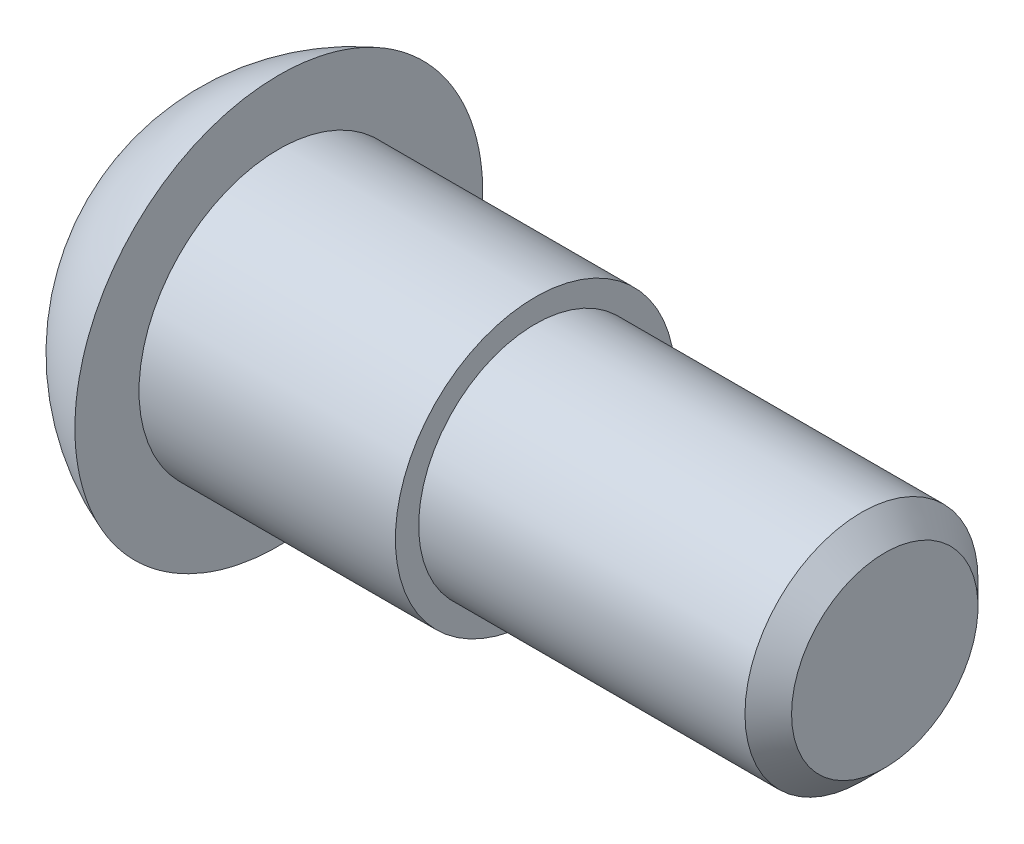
ISO-10303-21;
HEADER;
FILE_DESCRIPTION(('STEP AP214'),'2;1');
FILE_NAME('part.step','',(''),(''),'','','');
FILE_SCHEMA(('AUTOMOTIVE_DESIGN { 1 0 10303 214 1 1 1 1 }'));
ENDSEC;
DATA;
#1=APPLICATION_CONTEXT('core data for automotive mechanical design processes');
#2=APPLICATION_PROTOCOL_DEFINITION('international standard','automotive_design',2000,#1);
#3=PRODUCT_CONTEXT('',#1,'mechanical');
#4=PRODUCT('Part','Part','',(#3));
#5=PRODUCT_RELATED_PRODUCT_CATEGORY('part','',(#4));
#6=PRODUCT_DEFINITION_FORMATION('','',#4);
#7=PRODUCT_DEFINITION_CONTEXT('part definition',#1,'design');
#8=PRODUCT_DEFINITION('design','',#6,#7);
#9=PRODUCT_DEFINITION_SHAPE('','',#8);
#10=(LENGTH_UNIT() NAMED_UNIT(*) SI_UNIT(.MILLI.,.METRE.));
#11=(NAMED_UNIT(*) PLANE_ANGLE_UNIT() SI_UNIT($,.RADIAN.));
#12=(NAMED_UNIT(*) SI_UNIT($,.STERADIAN.) SOLID_ANGLE_UNIT());
#13=UNCERTAINTY_MEASURE_WITH_UNIT(LENGTH_MEASURE(1.E-05),#10,'distance_accuracy_value','');
#14=(GEOMETRIC_REPRESENTATION_CONTEXT(3) GLOBAL_UNCERTAINTY_ASSIGNED_CONTEXT((#13)) GLOBAL_UNIT_ASSIGNED_CONTEXT((#10,
#11,#12)) REPRESENTATION_CONTEXT('',''));
#15=CARTESIAN_POINT('',(0.,0.,0.));
#16=DIRECTION('',(0.,0.,1.));
#17=DIRECTION('',(1.,0.,0.));
#18=AXIS2_PLACEMENT_3D('',#15,#16,#17);
#19=CARTESIAN_POINT('',(-2.05766977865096,0.,0.));
#20=DIRECTION('',(-1.,0.,0.));
#21=DIRECTION('',(0.,0.,1.));
#22=AXIS2_PLACEMENT_3D('',#19,#20,#21);
#23=CONICAL_SURFACE('',#22,2.90497562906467,1.04719755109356);
#24=CARTESIAN_POINT('',(-2.04766666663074,-2.50077802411,-1.4438248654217));
#25=CARTESIAN_POINT('',(-2.01344823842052,-2.50077802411,-1.32530116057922));
#26=CARTESIAN_POINT('',(-1.98212030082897,-2.50077802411,-1.20583982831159));
#27=CARTESIAN_POINT('',(-1.92675205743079,-2.50077802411,-0.964976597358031));
#28=CARTESIAN_POINT('',(-1.90272805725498,-2.50077802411,-0.843570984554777));
#29=CARTESIAN_POINT('',(-1.8640945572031,-2.50077802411,-0.602122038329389));
#30=CARTESIAN_POINT('',(-1.84927907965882,-2.50077802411,-0.482112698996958));
#31=CARTESIAN_POINT('',(-1.82939017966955,-2.50077802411,-0.241401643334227));
#32=CARTESIAN_POINT('',(-1.82430618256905,-2.50077802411,-0.120700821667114));
#33=CARTESIAN_POINT('',(-1.82430618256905,-2.50077802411,0.120700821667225));
#34=CARTESIAN_POINT('',(-1.82939017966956,-2.50077802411,0.241401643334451));
#35=CARTESIAN_POINT('',(-1.84927907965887,-2.50077802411,0.482112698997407));
#36=CARTESIAN_POINT('',(-1.86409455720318,-2.50077802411,0.602122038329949));
#37=CARTESIAN_POINT('',(-1.90272805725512,-2.50077802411,0.843570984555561));
#38=CARTESIAN_POINT('',(-1.92675205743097,-2.50077802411,0.964976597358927));
#39=CARTESIAN_POINT('',(-1.98212030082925,-2.50077802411,1.20583982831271));
#40=CARTESIAN_POINT('',(-2.01344823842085,-2.50077802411,1.32530116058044));
#41=CARTESIAN_POINT('',(-2.04766666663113,-2.50077802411,1.44382486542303));
#42=B_SPLINE_CURVE_WITH_KNOTS('',3,(#24,#25,#26,#27,#28,#29,#30,#31,#32,#33,#34,#35,#36,#37,#38,
#39,#40,#41),.UNSPECIFIED.,.F.,.F.,(4,2,2,2,2,2,2,2,4),(0.,0.370206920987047,0.741234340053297,
1.10363192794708,1.46563549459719,1.82763906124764,2.19003664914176,2.56106406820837,
2.93127098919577),.UNSPECIFIED.);
#43=CARTESIAN_POINT('',(-2.04766666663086,-2.50077802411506,-1.44382486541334));
#44=VERTEX_POINT('',#43);
#45=CARTESIAN_POINT('',(-2.04766666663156,-2.50077802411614,1.44382486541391));
#46=VERTEX_POINT('',#45);
#47=EDGE_CURVE('E74',#44,#46,#42,.T.);
#48=ORIENTED_EDGE('',*,*,#47,.T.);
#49=CARTESIAN_POINT('',(-2.04766666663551,-2.50077802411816,1.44382486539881));
#50=CARTESIAN_POINT('',(-2.01102469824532,-2.3908839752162,1.5072722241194));
#51=CARTESIAN_POINT('',(-1.97770074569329,-2.2800413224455,1.57126725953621));
#52=CARTESIAN_POINT('',(-1.91953478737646,-2.05643685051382,1.70036536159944));
#53=CARTESIAN_POINT('',(-1.8947133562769,-1.94367105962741,1.7654707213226));
#54=CARTESIAN_POINT('',(-1.85607700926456,-1.71953692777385,1.89487462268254));
#55=CARTESIAN_POINT('',(-1.84200491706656,-1.60820306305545,1.9591532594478));
#56=CARTESIAN_POINT('',(-1.82520891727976,-1.38501174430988,2.0880128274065));
#57=CARTESIAN_POINT('',(-1.82247109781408,-1.27315510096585,2.15259329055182));
#58=CARTESIAN_POINT('',(-1.82818124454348,-1.06416296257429,2.27325495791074));
#59=CARTESIAN_POINT('',(-1.83522718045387,-0.966996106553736,2.32935426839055));
#60=CARTESIAN_POINT('',(-1.85755414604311,-0.773295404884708,2.44118742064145));
#61=CARTESIAN_POINT('',(-1.87284279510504,-0.676762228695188,2.49692087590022));
#62=CARTESIAN_POINT('',(-1.91106145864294,-0.482662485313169,2.60898441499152));
#63=CARTESIAN_POINT('',(-1.93415340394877,-0.385120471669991,2.66530032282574));
#64=CARTESIAN_POINT('',(-1.98656235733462,-0.191490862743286,2.77709242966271));
#65=CARTESIAN_POINT('',(-2.01586705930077,-0.0954007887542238,2.83257005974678));
#66=CARTESIAN_POINT('',(-2.04766666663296,8.40144272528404E-12,2.88764973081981));
#67=B_SPLINE_CURVE_WITH_KNOTS('',3,(#49,#50,#51,#52,#53,#54,#55,#56,#57,#58,#59,#60,#61,#62,#63,
#64,#65,#66),.UNSPECIFIED.,.F.,.F.,(4,2,2,2,2,2,2,2,4),(0.,0.396393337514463,0.793739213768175,
1.18125201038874,1.56828902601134,1.90522746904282,2.24247790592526,2.58720694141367,
2.93125941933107),.UNSPECIFIED.);
#68=CARTESIAN_POINT('',(-2.04766666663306,-2.97348732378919E-13,2.88764973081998));
#69=VERTEX_POINT('',#68);
#70=EDGE_CURVE('E77',#46,#69,#67,.T.);
#71=ORIENTED_EDGE('',*,*,#70,.T.);
#72=CARTESIAN_POINT('',(-2.04766666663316,-8.99585790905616E-12,2.88764973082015));
#73=CARTESIAN_POINT('',(-2.01102469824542,0.109894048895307,2.82420237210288));
#74=CARTESIAN_POINT('',(-1.97770074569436,0.220736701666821,2.76020733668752));
#75=CARTESIAN_POINT('',(-1.9195347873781,0.444341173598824,2.63110923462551));
#76=CARTESIAN_POINT('',(-1.89471335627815,0.557106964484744,2.56600387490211));
#77=CARTESIAN_POINT('',(-1.85607700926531,0.781241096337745,2.43659997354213));
#78=CARTESIAN_POINT('',(-1.8420049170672,0.892574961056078,2.37232133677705));
#79=CARTESIAN_POINT('',(-1.82520891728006,1.1157662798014,2.24346176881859));
#80=CARTESIAN_POINT('',(-1.82247109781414,1.22762292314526,2.17888130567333));
#81=CARTESIAN_POINT('',(-1.82818124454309,1.43661506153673,2.05821963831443));
#82=CARTESIAN_POINT('',(-1.83522718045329,1.53378191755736,2.00212032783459));
#83=CARTESIAN_POINT('',(-1.85755414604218,1.72748261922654,1.89028717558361));
#84=CARTESIAN_POINT('',(-1.87284279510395,1.82401579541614,1.83455372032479));
#85=CARTESIAN_POINT('',(-1.91106145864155,2.01811553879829,1.7224901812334));
#86=CARTESIAN_POINT('',(-1.93415340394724,2.11565755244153,1.66617427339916));
#87=CARTESIAN_POINT('',(-1.98656235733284,2.30928716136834,1.55438216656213));
#88=CARTESIAN_POINT('',(-2.01586705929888,2.40537723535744,1.49890453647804));
#89=CARTESIAN_POINT('',(-2.04766666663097,2.50077802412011,1.44382486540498));
#90=B_SPLINE_CURVE_WITH_KNOTS('',3,(#72,#73,#74,#75,#76,#77,#78,#79,#80,#81,#82,#83,#84,#85,#86,
#87,#88,#89),.UNSPECIFIED.,.F.,.F.,(4,2,2,2,2,2,2,2,4),(0.,0.396393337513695,0.793739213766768,
1.18125201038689,1.56828902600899,1.90522746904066,2.24247790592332,2.58720694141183,
2.93125941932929),.UNSPECIFIED.);
#91=CARTESIAN_POINT('',(-2.04766666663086,2.50077802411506,1.44382486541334));
#92=VERTEX_POINT('',#91);
#93=EDGE_CURVE('E107',#69,#92,#90,.T.);
#94=ORIENTED_EDGE('',*,*,#93,.T.);
#95=CARTESIAN_POINT('',(-2.04766666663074,2.50077802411,1.4438248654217));
#96=CARTESIAN_POINT('',(-2.01344823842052,2.50077802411,1.32530116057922));
#97=CARTESIAN_POINT('',(-1.98212030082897,2.50077802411,1.20583982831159));
#98=CARTESIAN_POINT('',(-1.92675205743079,2.50077802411,0.964976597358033));
#99=CARTESIAN_POINT('',(-1.90272805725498,2.50077802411,0.84357098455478));
#100=CARTESIAN_POINT('',(-1.8640945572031,2.50077802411,0.602122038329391));
#101=CARTESIAN_POINT('',(-1.84927907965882,2.50077802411,0.48211269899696));
#102=CARTESIAN_POINT('',(-1.82939017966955,2.50077802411,0.241401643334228));
#103=CARTESIAN_POINT('',(-1.82430618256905,2.50077802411,0.120700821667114));
#104=CARTESIAN_POINT('',(-1.82430618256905,2.50077802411,-0.120700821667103));
#105=CARTESIAN_POINT('',(-1.82939017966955,2.50077802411,-0.241401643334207));
#106=CARTESIAN_POINT('',(-1.84927907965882,2.50077802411,-0.482112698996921));
#107=CARTESIAN_POINT('',(-1.8640945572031,2.50077802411,-0.602122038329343));
#108=CARTESIAN_POINT('',(-1.90272805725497,2.50077802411,-0.843570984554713));
#109=CARTESIAN_POINT('',(-1.92675205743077,2.50077802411,-0.964976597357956));
#110=CARTESIAN_POINT('',(-1.98212030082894,2.50077802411,-1.2058398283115));
#111=CARTESIAN_POINT('',(-2.01344823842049,2.50077802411,-1.32530116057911));
#112=CARTESIAN_POINT('',(-2.04766666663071,2.50077802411,-1.44382486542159));
#113=B_SPLINE_CURVE_WITH_KNOTS('',3,(#95,#96,#97,#98,#99,#100,#101,#102,#103,#104,#105,#106,
#107,#108,#109,#110,#111,#112),.UNSPECIFIED.,.F.,.F.,(4,2,2,2,2,2,2,2,4),(0.,0.370206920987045,
0.741234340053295,1.10363192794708,1.46563549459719,1.82763906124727,2.19003664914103,
2.56106406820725,2.93127098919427),.UNSPECIFIED.);
#114=CARTESIAN_POINT('',(-2.04766666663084,2.50077802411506,-1.44382486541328));
#115=VERTEX_POINT('',#114);
#116=EDGE_CURVE('E112',#92,#115,#113,.T.);
#117=ORIENTED_EDGE('',*,*,#116,.T.);
#118=CARTESIAN_POINT('',(-2.04766666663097,2.50077802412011,-1.44382486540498));
#119=CARTESIAN_POINT('',(-2.01102469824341,2.39088397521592,-1.50727222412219));
#120=CARTESIAN_POINT('',(-1.97770074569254,2.28004132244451,-1.57126725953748));
#121=CARTESIAN_POINT('',(-1.91953478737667,2.05643685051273,-1.70036536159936));
#122=CARTESIAN_POINT('',(-1.89471335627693,1.94367105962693,-1.7654707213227));
#123=CARTESIAN_POINT('',(-1.8560770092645,1.71953692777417,-1.89487462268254));
#124=CARTESIAN_POINT('',(-1.84200491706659,1.60820306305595,-1.95915325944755));
#125=CARTESIAN_POINT('',(-1.82520891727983,1.38501174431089,-2.08801282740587));
#126=CARTESIAN_POINT('',(-1.82247109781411,1.27315510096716,-2.15259329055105));
#127=CARTESIAN_POINT('',(-1.82818124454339,1.0641629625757,-2.27325495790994));
#128=CARTESIAN_POINT('',(-1.83522718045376,0.966996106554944,-2.32935426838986));
#129=CARTESIAN_POINT('',(-1.85755414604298,0.773295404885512,-2.44118742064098));
#130=CARTESIAN_POINT('',(-1.87284279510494,0.676762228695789,-2.49692087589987));
#131=CARTESIAN_POINT('',(-1.91106145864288,0.482662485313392,-2.60898441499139));
#132=CARTESIAN_POINT('',(-1.93415340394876,0.385120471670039,-2.66530032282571));
#133=CARTESIAN_POINT('',(-1.9865623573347,0.191490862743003,-2.77709242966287));
#134=CARTESIAN_POINT('',(-2.01586705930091,0.0954007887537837,-2.83257005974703));
#135=CARTESIAN_POINT('',(-2.04766666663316,-8.99572751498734E-12,-2.88764973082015));
#136=B_SPLINE_CURVE_WITH_KNOTS('',3,(#118,#119,#120,#121,#122,#123,#124,#125,#126,#127,#128,
#129,#130,#131,#132,#133,#134,#135),.UNSPECIFIED.,.F.,.F.,(4,2,2,2,2,2,2,2,4),(0.,
0.396393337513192,0.793739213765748,1.18125201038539,1.56828902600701,1.90522746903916,
2.24247790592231,2.58720694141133,2.9312594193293),.UNSPECIFIED.);
#137=CARTESIAN_POINT('',(-2.0476666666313,-5.57113034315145E-12,-2.88764973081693));
#138=VERTEX_POINT('',#137);
#139=EDGE_CURVE('E20',#115,#138,#136,.T.);
#140=ORIENTED_EDGE('',*,*,#139,.T.);
#141=CARTESIAN_POINT('',(-2.04766666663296,8.40110502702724E-12,-2.88764973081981));
#142=CARTESIAN_POINT('',(-2.01102469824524,-0.109894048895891,-2.82420237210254));
#143=CARTESIAN_POINT('',(-1.97770074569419,-0.220736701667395,-2.76020733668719));
#144=CARTESIAN_POINT('',(-1.91953478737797,-0.444341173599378,-2.63110923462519));
#145=CARTESIAN_POINT('',(-1.89471335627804,-0.557106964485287,-2.5660038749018));
#146=CARTESIAN_POINT('',(-1.85607700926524,-0.781241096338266,-2.43659997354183));
#147=CARTESIAN_POINT('',(-1.84200491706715,-0.892574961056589,-2.37232133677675));
#148=CARTESIAN_POINT('',(-1.82520891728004,-1.11576627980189,-2.2434617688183));
#149=CARTESIAN_POINT('',(-1.82247109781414,-1.22762292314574,-2.17888130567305));
#150=CARTESIAN_POINT('',(-1.82818124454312,-1.43661506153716,-2.05821963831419));
#151=CARTESIAN_POINT('',(-1.83522718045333,-1.53378191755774,-2.00212032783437));
#152=CARTESIAN_POINT('',(-1.85755414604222,-1.72748261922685,-1.89028717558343));
#153=CARTESIAN_POINT('',(-1.872842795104,-1.82401579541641,-1.83455372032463));
#154=CARTESIAN_POINT('',(-1.91106145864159,-2.01811553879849,-1.72249018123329));
#155=CARTESIAN_POINT('',(-1.93415340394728,-2.11565755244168,-1.66617427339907));
#156=CARTESIAN_POINT('',(-1.98656235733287,-2.30928716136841,-1.55438216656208));
#157=CARTESIAN_POINT('',(-2.01586705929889,-2.40537723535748,-1.49890453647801));
#158=CARTESIAN_POINT('',(-2.04766666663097,-2.50077802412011,-1.44382486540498));
#159=B_SPLINE_CURVE_WITH_KNOTS('',3,(#141,#142,#143,#144,#145,#146,#147,#148,#149,#150,#151,
#152,#153,#154,#155,#156,#157,#158),.UNSPECIFIED.,.F.,.F.,(4,2,2,2,2,2,2,2,4),(0.,
0.396393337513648,0.793739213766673,1.18125201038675,1.56828902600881,1.90522746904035,
2.24247790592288,2.58720694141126,2.93125941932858),.UNSPECIFIED.);
#160=EDGE_CURVE('E80',#138,#44,#159,.T.);
#161=ORIENTED_EDGE('',*,*,#160,.T.);
#162=EDGE_LOOP('',(#48,#71,#94,#117,#140,#161));
#163=FACE_BOUND('',#162,.T.);
#164=CARTESIAN_POINT('',(-0.380481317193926,-3.41060513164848E-10,0.));
#165=VERTEX_POINT('',#164);
#166=VERTEX_LOOP('',#165);
#167=FACE_BOUND('',#166,.T.);
#168=ADVANCED_FACE('F16',(#163,#167),#23,.F.);
#169=CARTESIAN_POINT('',(-5.501,1.25038901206,-2.16573729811));
#170=DIRECTION('',(0.,0.50000000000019,-0.866025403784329));
#171=DIRECTION('',(0.,0.866025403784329,0.50000000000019));
#172=AXIS2_PLACEMENT_3D('',#169,#170,#171);
#173=PLANE('',#172);
#174=DIRECTION('',(0.,0.86602540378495,0.499999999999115));
#175=VECTOR('',#174,1.);
#176=CARTESIAN_POINT('',(-5.5,0.,-2.88764973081));
#177=LINE('',#176,#175);
#178=CARTESIAN_POINT('',(-5.5,-2.1462866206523E-12,-2.88764973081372));
#179=VERTEX_POINT('',#178);
#180=CARTESIAN_POINT('',(-5.5,2.50077802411,-1.4438248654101));
#181=VERTEX_POINT('',#180);
#182=EDGE_CURVE('E115',#179,#181,#177,.T.);
#183=ORIENTED_EDGE('',*,*,#182,.F.);
#184=DIRECTION('',(1.,0.,0.));
#185=VECTOR('',#184,1.);
#186=CARTESIAN_POINT('',(-5.501,-2.1462866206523E-12,-2.88764973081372));
#187=LINE('',#186,#185);
#188=EDGE_CURVE('E119',#179,#138,#187,.T.);
#189=ORIENTED_EDGE('',*,*,#188,.T.);
#190=ORIENTED_EDGE('',*,*,#139,.F.);
#191=DIRECTION('',(1.,0.,0.));
#192=VECTOR('',#191,1.);
#193=CARTESIAN_POINT('',(-5.501,2.50077802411,-1.44382486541));
#194=LINE('',#193,#192);
#195=EDGE_CURVE('E110',#115,#181,#194,.F.);
#196=ORIENTED_EDGE('',*,*,#195,.T.);
#197=EDGE_LOOP('',(#183,#189,#190,#196));
#198=FACE_BOUND('',#197,.T.);
#199=ADVANCED_FACE('F184',(#198),#173,.F.);
#200=CARTESIAN_POINT('',(-5.501,2.50077802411,0.));
#201=DIRECTION('',(0.,1.,0.));
#202=DIRECTION('',(0.,0.,1.));
#203=AXIS2_PLACEMENT_3D('',#200,#201,#202);
#204=PLANE('',#203);
#205=DIRECTION('',(1.,0.,0.));
#206=VECTOR('',#205,1.);
#207=CARTESIAN_POINT('',(-5.501,2.50077802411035,1.44382486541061));
#208=LINE('',#207,#206);
#209=CARTESIAN_POINT('',(-5.5,2.50077802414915,1.44382486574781));
#210=VERTEX_POINT('',#209);
#211=EDGE_CURVE('E89',#92,#210,#208,.F.);
#212=ORIENTED_EDGE('',*,*,#211,.T.);
#213=DIRECTION('',(0.,0.,1.));
#214=VECTOR('',#213,1.);
#215=CARTESIAN_POINT('',(-5.5,2.50077802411,0.));
#216=LINE('',#215,#214);
#217=EDGE_CURVE('E118',#181,#210,#216,.T.);
#218=ORIENTED_EDGE('',*,*,#217,.F.);
#219=ORIENTED_EDGE('',*,*,#195,.F.);
#220=ORIENTED_EDGE('',*,*,#116,.F.);
#221=EDGE_LOOP('',(#212,#218,#219,#220));
#222=FACE_BOUND('',#221,.T.);
#223=ADVANCED_FACE('F211',(#222),#204,.F.);
#224=CARTESIAN_POINT('',(-5.501,1.25038901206,2.16573729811));
#225=DIRECTION('',(0.,0.50000000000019,0.866025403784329));
#226=DIRECTION('',(0.,-0.866025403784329,0.50000000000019));
#227=AXIS2_PLACEMENT_3D('',#224,#225,#226);
#228=PLANE('',#227);
#229=DIRECTION('',(0.,-0.866025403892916,0.499999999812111));
#230=VECTOR('',#229,1.);
#231=CARTESIAN_POINT('',(-5.5,2.50077802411,1.44382486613));
#232=LINE('',#231,#230);
#233=CARTESIAN_POINT('',(-5.5,-2.68471195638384E-13,2.88764973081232));
#234=VERTEX_POINT('',#233);
#235=EDGE_CURVE('E133',#210,#234,#232,.T.);
#236=ORIENTED_EDGE('',*,*,#235,.F.);
#237=ORIENTED_EDGE('',*,*,#211,.F.);
#238=ORIENTED_EDGE('',*,*,#93,.F.);
#239=DIRECTION('',(1.,0.,0.));
#240=VECTOR('',#239,1.);
#241=CARTESIAN_POINT('',(-5.501,-2.1462866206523E-12,2.88764973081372));
#242=LINE('',#241,#240);
#243=EDGE_CURVE('E83',#69,#234,#242,.F.);
#244=ORIENTED_EDGE('',*,*,#243,.T.);
#245=EDGE_LOOP('',(#236,#237,#238,#244));
#246=FACE_BOUND('',#245,.T.);
#247=ADVANCED_FACE('F194',(#246),#228,.F.);
#248=CARTESIAN_POINT('',(-5.501,-1.25038901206,2.16573729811));
#249=DIRECTION('',(0.,-0.50000000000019,0.866025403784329));
#250=DIRECTION('',(0.,-0.866025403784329,-0.50000000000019));
#251=AXIS2_PLACEMENT_3D('',#248,#249,#250);
#252=PLANE('',#251);
#253=ORIENTED_EDGE('',*,*,#243,.F.);
#254=ORIENTED_EDGE('',*,*,#70,.F.);
#255=DIRECTION('',(1.,0.,0.));
#256=VECTOR('',#255,1.);
#257=CARTESIAN_POINT('',(-5.501,-2.50077802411,1.44382486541));
#258=LINE('',#257,#256);
#259=CARTESIAN_POINT('',(-5.5,-2.50077802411,1.44382486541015));
#260=VERTEX_POINT('',#259);
#261=EDGE_CURVE('E82',#46,#260,#258,.F.);
#262=ORIENTED_EDGE('',*,*,#261,.T.);
#263=DIRECTION('',(0.,-0.86602540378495,-0.499999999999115));
#264=VECTOR('',#263,1.);
#265=CARTESIAN_POINT('',(-5.5,0.,2.88764973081));
#266=LINE('',#265,#264);
#267=EDGE_CURVE('E129',#234,#260,#266,.T.);
#268=ORIENTED_EDGE('',*,*,#267,.F.);
#269=EDGE_LOOP('',(#253,#254,#262,#268));
#270=FACE_BOUND('',#269,.T.);
#271=ADVANCED_FACE('F87',(#270),#252,.F.);
#272=CARTESIAN_POINT('',(-5.501,-2.50077802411,0.));
#273=DIRECTION('',(0.,-1.,0.));
#274=DIRECTION('',(0.,0.,-1.));
#275=AXIS2_PLACEMENT_3D('',#272,#273,#274);
#276=PLANE('',#275);
#277=DIRECTION('',(0.,0.,1.));
#278=VECTOR('',#277,1.);
#279=CARTESIAN_POINT('',(-5.5,-2.50077802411,0.));
#280=LINE('',#279,#278);
#281=CARTESIAN_POINT('',(-5.5,-2.50077802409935,-1.44382486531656));
#282=VERTEX_POINT('',#281);
#283=EDGE_CURVE('E93',#260,#282,#280,.F.);
#284=ORIENTED_EDGE('',*,*,#283,.F.);
#285=ORIENTED_EDGE('',*,*,#261,.F.);
#286=ORIENTED_EDGE('',*,*,#47,.F.);
#287=DIRECTION('',(1.,0.,0.));
#288=VECTOR('',#287,1.);
#289=CARTESIAN_POINT('',(-5.501,-2.50077802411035,-1.44382486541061));
#290=LINE('',#289,#288);
#291=EDGE_CURVE('E38',#44,#282,#290,.F.);
#292=ORIENTED_EDGE('',*,*,#291,.T.);
#293=EDGE_LOOP('',(#284,#285,#286,#292));
#294=FACE_BOUND('',#293,.T.);
#295=ADVANCED_FACE('F91',(#294),#276,.F.);
#296=CARTESIAN_POINT('',(-5.501,-1.25038901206,-2.16573729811));
#297=DIRECTION('',(0.,-0.50000000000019,-0.866025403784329));
#298=DIRECTION('',(0.,0.866025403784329,-0.50000000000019));
#299=AXIS2_PLACEMENT_3D('',#296,#297,#298);
#300=PLANE('',#299);
#301=DIRECTION('',(0.,0.866025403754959,-0.50000000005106));
#302=VECTOR('',#301,1.);
#303=CARTESIAN_POINT('',(-5.5,-2.50077802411,-1.44382486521));
#304=LINE('',#303,#302);
#305=EDGE_CURVE('E122',#282,#179,#304,.T.);
#306=ORIENTED_EDGE('',*,*,#305,.F.);
#307=ORIENTED_EDGE('',*,*,#291,.F.);
#308=ORIENTED_EDGE('',*,*,#160,.F.);
#309=ORIENTED_EDGE('',*,*,#188,.F.);
#310=EDGE_LOOP('',(#306,#307,#308,#309));
#311=FACE_BOUND('',#310,.T.);
#312=ADVANCED_FACE('F187',(#311),#300,.F.);
#313=CARTESIAN_POINT('',(-5.5,2.2650822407,0.));
#314=DIRECTION('',(-1.,0.,0.));
#315=DIRECTION('',(0.,-1.,0.));
#316=AXIS2_PLACEMENT_3D('',#313,#314,#315);
#317=PLANE('',#316);
#318=ORIENTED_EDGE('',*,*,#283,.T.);
#319=ORIENTED_EDGE('',*,*,#305,.T.);
#320=ORIENTED_EDGE('',*,*,#182,.T.);
#321=ORIENTED_EDGE('',*,*,#217,.T.);
#322=ORIENTED_EDGE('',*,*,#235,.T.);
#323=ORIENTED_EDGE('',*,*,#267,.T.);
#324=EDGE_LOOP('',(#318,#319,#320,#321,#322,#323));
#325=FACE_BOUND('',#324,.T.);
#326=CARTESIAN_POINT('',(-5.5,-1.6241257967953,2.97294232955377));
#327=CARTESIAN_POINT('',(-5.50000000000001,-1.70759642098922,2.92734147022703));
#328=CARTESIAN_POINT('',(-5.50000000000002,-1.78916074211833,2.87821468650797));
#329=CARTESIAN_POINT('',(-5.49999999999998,-1.94788110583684,2.77326308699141));
#330=CARTESIAN_POINT('',(-5.49999999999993,-2.02503583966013,2.71743629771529));
#331=CARTESIAN_POINT('',(-5.50000000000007,-2.17449735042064,2.59938641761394));
#332=CARTESIAN_POINT('',(-5.50000000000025,-2.24679621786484,2.53715329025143));
#333=CARTESIAN_POINT('',(-5.49999999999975,-2.38593385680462,2.40678187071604));
#334=CARTESIAN_POINT('',(-5.49999999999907,-2.45276814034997,2.33863881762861));
#335=CARTESIAN_POINT('',(-5.49999999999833,-2.64405647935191,2.12633802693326));
#336=CARTESIAN_POINT('',(-5.49999999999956,-2.75965702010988,1.97402289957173));
#337=CARTESIAN_POINT('',(-5.50000000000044,-2.96360884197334,1.65211977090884));
#338=CARTESIAN_POINT('',(-5.50000000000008,-3.05195908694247,1.48253111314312));
#339=CARTESIAN_POINT('',(-5.49999999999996,-3.16218025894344,1.21897468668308));
#340=CARTESIAN_POINT('',(-5.49999999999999,-3.19521757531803,1.12953214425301));
#341=CARTESIAN_POINT('',(-5.50000000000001,-3.25362017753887,0.94824899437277));
#342=CARTESIAN_POINT('',(-5.5,-3.27899282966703,0.856410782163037));
#343=CARTESIAN_POINT('',(-5.5,-3.32192100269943,0.670880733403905));
#344=CARTESIAN_POINT('',(-5.5,-3.33947297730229,0.577188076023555));
#345=CARTESIAN_POINT('',(-5.5,-3.36663020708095,0.38866019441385));
#346=CARTESIAN_POINT('',(-5.5,-3.37623362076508,0.293824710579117));
#347=CARTESIAN_POINT('',(-5.50000000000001,-3.39297258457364,0.00866198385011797));
#348=CARTESIAN_POINT('',(-5.5,-3.38808200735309,-0.182517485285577));
#349=CARTESIAN_POINT('',(-5.5,-3.34627124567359,-0.561235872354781));
#350=CARTESIAN_POINT('',(-5.5,-3.3093514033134,-0.74877482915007));
#351=CARTESIAN_POINT('',(-5.5,-3.20455290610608,-1.11502061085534));
#352=CARTESIAN_POINT('',(-5.5,-3.13667408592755,-1.29372738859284));
#353=CARTESIAN_POINT('',(-5.5,-2.97187079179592,-1.63720459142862));
#354=CARTESIAN_POINT('',(-5.5,-2.87494631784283,-1.80197501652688));
#355=CARTESIAN_POINT('',(-5.5,-2.65483580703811,-2.11289310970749));
#356=CARTESIAN_POINT('',(-5.5,-2.53164991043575,-2.25904087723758));
#357=CARTESIAN_POINT('',(-5.5,-2.2623969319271,-2.52863054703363));
#358=CARTESIAN_POINT('',(-5.5,-2.11632960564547,-2.65207220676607));
#359=CARTESIAN_POINT('',(-5.5,-1.88341737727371,-2.81745016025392));
#360=CARTESIAN_POINT('',(-5.5,-1.80343281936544,-2.86930057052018));
#361=CARTESIAN_POINT('',(-5.5,-1.63938054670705,-2.96608450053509));
#362=CARTESIAN_POINT('',(-5.5,-1.55531378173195,-3.01101961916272));
#363=CARTESIAN_POINT('',(-5.5,-1.38373157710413,-3.09362575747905));
#364=CARTESIAN_POINT('',(-5.5,-1.29621771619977,-3.13130005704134));
#365=CARTESIAN_POINT('',(-5.5,-1.11826543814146,-3.199178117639));
#366=CARTESIAN_POINT('',(-5.5,-1.02782428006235,-3.22937463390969));
#367=CARTESIAN_POINT('',(-5.5,-0.753271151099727,-3.30831306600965));
#368=CARTESIAN_POINT('',(-5.5,-0.565701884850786,-3.34551318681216));
#369=CARTESIAN_POINT('',(-5.5,-0.186985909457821,-3.38784733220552));
#370=CARTESIAN_POINT('',(-5.5,0.00416066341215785,-3.39298257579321));
#371=CARTESIAN_POINT('',(-5.5,0.289458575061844,-3.37661321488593));
#372=CARTESIAN_POINT('',(-5.5,0.384433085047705,-3.36711902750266));
#373=CARTESIAN_POINT('',(-5.5,0.573190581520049,-3.34016356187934));
#374=CARTESIAN_POINT('',(-5.5,0.666974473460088,-3.32270876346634));
#375=CARTESIAN_POINT('',(-5.5,0.852580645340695,-3.27999030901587));
#376=CARTESIAN_POINT('',(-5.5,0.944405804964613,-3.25473910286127));
#377=CARTESIAN_POINT('',(-5.5,1.12558834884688,-3.19660238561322));
#378=CARTESIAN_POINT('',(-5.5,1.21494645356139,-3.16371913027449));
#379=CARTESIAN_POINT('',(-5.5,1.35761774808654,-3.10428421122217));
#380=CARTESIAN_POINT('',(-5.5,1.41188015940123,-3.07998337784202));
#381=CARTESIAN_POINT('',(-5.5,1.51905182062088,-3.02856149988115));
#382=CARTESIAN_POINT('',(-5.5,1.57196107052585,-3.00144045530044));
#383=CARTESIAN_POINT('',(-5.5,1.70759642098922,-2.92734147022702));
#384=CARTESIAN_POINT('',(-5.50000000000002,1.78916074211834,-2.87821468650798));
#385=CARTESIAN_POINT('',(-5.49999999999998,1.94788110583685,-2.77326308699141));
#386=CARTESIAN_POINT('',(-5.49999999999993,2.02503583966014,-2.71743629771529));
#387=CARTESIAN_POINT('',(-5.50000000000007,2.17449735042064,-2.59938641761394));
#388=CARTESIAN_POINT('',(-5.50000000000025,2.24679621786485,-2.53715329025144));
#389=CARTESIAN_POINT('',(-5.49999999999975,2.38593385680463,-2.40678187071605));
#390=CARTESIAN_POINT('',(-5.49999999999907,2.45276814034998,-2.33863881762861));
#391=CARTESIAN_POINT('',(-5.49999999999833,2.64405647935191,-2.12633802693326));
#392=CARTESIAN_POINT('',(-5.49999999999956,2.75965702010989,-1.97402289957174));
#393=CARTESIAN_POINT('',(-5.50000000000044,2.96360884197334,-1.65211977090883));
#394=CARTESIAN_POINT('',(-5.50000000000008,3.05195908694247,-1.48253111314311));
#395=CARTESIAN_POINT('',(-5.49999999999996,3.16218025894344,-1.21897468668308));
#396=CARTESIAN_POINT('',(-5.49999999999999,3.19521757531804,-1.12953214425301));
#397=CARTESIAN_POINT('',(-5.50000000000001,3.25362017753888,-0.948248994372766));
#398=CARTESIAN_POINT('',(-5.5,3.27899282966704,-0.856410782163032));
#399=CARTESIAN_POINT('',(-5.5,3.32192100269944,-0.670880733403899));
#400=CARTESIAN_POINT('',(-5.5,3.3394729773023,-0.577188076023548));
#401=CARTESIAN_POINT('',(-5.5,3.36663020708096,-0.388660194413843));
#402=CARTESIAN_POINT('',(-5.5,3.37623362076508,-0.293824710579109));
#403=CARTESIAN_POINT('',(-5.5,3.39297258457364,-0.00866198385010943));
#404=CARTESIAN_POINT('',(-5.5,3.3880820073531,0.182517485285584));
#405=CARTESIAN_POINT('',(-5.5,3.3462712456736,0.561235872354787));
#406=CARTESIAN_POINT('',(-5.5,3.3093514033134,0.748774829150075));
#407=CARTESIAN_POINT('',(-5.5,3.20455290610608,1.11502061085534));
#408=CARTESIAN_POINT('',(-5.5,3.13667408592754,1.29372738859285));
#409=CARTESIAN_POINT('',(-5.5,2.97187079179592,1.63720459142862));
#410=CARTESIAN_POINT('',(-5.5,2.87494631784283,1.80197501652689));
#411=CARTESIAN_POINT('',(-5.5,2.65483580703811,2.11289310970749));
#412=CARTESIAN_POINT('',(-5.5,2.53164991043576,2.25904087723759));
#413=CARTESIAN_POINT('',(-5.5,2.26239693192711,2.52863054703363));
#414=CARTESIAN_POINT('',(-5.5,2.11632960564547,2.65207220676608));
#415=CARTESIAN_POINT('',(-5.5,1.88341737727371,2.81745016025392));
#416=CARTESIAN_POINT('',(-5.5,1.80343281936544,2.86930057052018));
#417=CARTESIAN_POINT('',(-5.5,1.63938054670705,2.96608450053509));
#418=CARTESIAN_POINT('',(-5.5,1.55531378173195,3.01101961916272));
#419=CARTESIAN_POINT('',(-5.5,1.38373157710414,3.09362575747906));
#420=CARTESIAN_POINT('',(-5.5,1.29621771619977,3.13130005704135));
#421=CARTESIAN_POINT('',(-5.5,1.11826543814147,3.199178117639));
#422=CARTESIAN_POINT('',(-5.5,1.02782428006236,3.22937463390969));
#423=CARTESIAN_POINT('',(-5.5,0.75327115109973,3.30831306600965));
#424=CARTESIAN_POINT('',(-5.5,0.565701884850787,3.34551318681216));
#425=CARTESIAN_POINT('',(-5.5,0.186985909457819,3.38784733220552));
#426=CARTESIAN_POINT('',(-5.5,-0.00416066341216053,3.3929825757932));
#427=CARTESIAN_POINT('',(-5.5,-0.289458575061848,3.37661321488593));
#428=CARTESIAN_POINT('',(-5.5,-0.384433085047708,3.36711902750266));
#429=CARTESIAN_POINT('',(-5.5,-0.573190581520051,3.34016356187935));
#430=CARTESIAN_POINT('',(-5.5,-0.666974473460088,3.32270876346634));
#431=CARTESIAN_POINT('',(-5.5,-0.852580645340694,3.27999030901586));
#432=CARTESIAN_POINT('',(-5.5,-0.944405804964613,3.25473910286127));
#433=CARTESIAN_POINT('',(-5.5,-1.12558834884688,3.19660238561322));
#434=CARTESIAN_POINT('',(-5.5,-1.21494645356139,3.1637191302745));
#435=CARTESIAN_POINT('',(-5.5,-1.35761774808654,3.10428421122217));
#436=CARTESIAN_POINT('',(-5.5,-1.41188015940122,3.07998337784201));
#437=CARTESIAN_POINT('',(-5.5,-1.51905182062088,3.02856149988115));
#438=CARTESIAN_POINT('',(-5.5,-1.57196107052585,3.00144045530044));
#439=CARTESIAN_POINT('',(-5.5,-1.6241257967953,2.97294232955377));
#440=B_SPLINE_CURVE_WITH_KNOTS('',3,(#326,#327,#328,#329,#330,#331,#332,#333,#334,#335,#336,
#337,#338,#339,#340,#341,#342,#343,#344,#345,#346,#347,#348,#349,#350,#351,#352,#353,#354,#355,
#356,#357,#358,#359,#360,#361,#362,#363,#364,#365,#366,#367,#368,#369,#370,#371,#372,#373,#374,
#375,#376,#377,#378,#379,#380,#381,#382,#383,#384,#385,#386,#387,#388,#389,#390,#391,#392,#393,
#394,#395,#396,#397,#398,#399,#400,#401,#402,#403,#404,#405,#406,#407,#408,#409,#410,#411,#412,
#413,#414,#415,#416,#417,#418,#419,#420,#421,#422,#423,#424,#425,#426,#427,#428,#429,#430,#431,
#432,#433,#434,#435,#436,#437,#438,#439),.UNSPECIFIED.,.T.,.F.,(4,2,2,2,2,2,2,2,2,2,2,2,2,2,2,2,
2,2,2,2,2,2,2,2,2,2,2,2,2,2,2,2,2,2,2,2,2,2,2,2,2,2,2,2,2,2,2,2,2,2,2,2,2,2,2,2,4),(0.,
0.285289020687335,0.570662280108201,0.856489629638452,1.1425494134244,1.71330536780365,
2.2840830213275,2.5698458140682,2.85533308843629,3.14094968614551,3.42663243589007,
3.99740228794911,4.56816604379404,5.13893284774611,5.70969965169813,6.28046340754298,
6.8512332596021,7.13691600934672,7.42253260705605,7.70801988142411,7.99378267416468,
8.56456032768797,9.13531628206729,9.4213760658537,9.70720341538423,9.99257667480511,
10.2778656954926,10.4561562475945,10.6344467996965,10.9197358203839,11.2051090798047,
11.490936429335,11.7769962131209,12.3477521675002,12.918529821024,13.2042926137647,
13.4897798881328,13.775396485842,14.0610792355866,14.6318490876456,15.2026128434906,
15.7733796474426,16.3441464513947,16.9149102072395,17.4856800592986,17.7713628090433,
18.0569794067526,18.3424666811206,18.6282294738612,19.1990071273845,19.7697630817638,
20.0558228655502,20.3416502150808,20.6270234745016,20.9123124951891,21.0906030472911,
21.2688935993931),.UNSPECIFIED.);
#441=CARTESIAN_POINT('',(-5.5,-1.6241257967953,2.97294232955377));
#442=VERTEX_POINT('',#441);
#443=EDGE_CURVE('E125',#442,#442,#440,.T.);
#444=ORIENTED_EDGE('',*,*,#443,.F.);
#445=EDGE_LOOP('',(#444));
#446=FACE_BOUND('',#445,.T.);
#447=ADVANCED_FACE('F172',(#325,#446),#317,.T.);
#448=CARTESIAN_POINT('',(3.16693902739,0.,0.));
#449=DIRECTION('',(0.,-0.479425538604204,0.877582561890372));
#450=DIRECTION('',(0.,-0.877582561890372,-0.479425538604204));
#451=AXIS2_PLACEMENT_3D('',#448,#449,#450);
#452=SPHERICAL_SURFACE('',#451,9.30548240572);
#453=CARTESIAN_POINT('',(0.,8.74999999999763,0.));
#454=CARTESIAN_POINT('',(0.,8.74999866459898,0.245569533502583));
#455=CARTESIAN_POINT('',(0.,8.73965179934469,0.491217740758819));
#456=CARTESIAN_POINT('',(0.,8.69832208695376,0.980878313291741));
#457=CARTESIAN_POINT('',(0.,8.66732684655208,1.22488960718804));
#458=CARTESIAN_POINT('',(0.,8.58481853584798,1.7099834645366));
#459=CARTESIAN_POINT('',(0.,8.53326040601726,1.95105838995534));
#460=CARTESIAN_POINT('',(0.,8.40999246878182,2.42800338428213));
#461=CARTESIAN_POINT('',(0.,8.33828214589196,2.66387331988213));
#462=CARTESIAN_POINT('',(0.,8.17530195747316,3.12849580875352));
#463=CARTESIAN_POINT('',(0.,8.08405140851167,3.35725513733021));
#464=CARTESIAN_POINT('',(0.,7.88259434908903,3.80627913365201));
#465=CARTESIAN_POINT('',(0.,7.77238712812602,4.02654348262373));
#466=CARTESIAN_POINT('',(0.,7.53390317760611,4.45682124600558));
#467=CARTESIAN_POINT('',(0.,7.40564165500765,4.66684308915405));
#468=CARTESIAN_POINT('',(0.,7.13183224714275,5.07542833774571));
#469=CARTESIAN_POINT('',(0.,6.98627704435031,5.27398683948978));
#470=CARTESIAN_POINT('',(0.,6.67893829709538,5.65816252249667));
#471=CARTESIAN_POINT('',(0.,6.51715263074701,5.84377800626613));
#472=CARTESIAN_POINT('',(0.,6.17859117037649,6.20064349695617));
#473=CARTESIAN_POINT('',(0.,6.00182177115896,6.37189957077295));
#474=CARTESIAN_POINT('',(0.,5.6343854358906,6.69901018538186));
#475=CARTESIAN_POINT('',(0.,5.44371070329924,6.85485596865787));
#476=CARTESIAN_POINT('',(0.,5.04991119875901,7.14992533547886));
#477=CARTESIAN_POINT('',(0.,4.84678661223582,7.28914916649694));
#478=CARTESIAN_POINT('',(0.,4.42943753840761,7.55004439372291));
#479=CARTESIAN_POINT('',(0.,4.21520823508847,7.67170808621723));
#480=CARTESIAN_POINT('',(0.,3.77726024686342,7.89654318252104));
#481=CARTESIAN_POINT('',(0.,3.553541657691,7.9997147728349));
#482=CARTESIAN_POINT('',(0.,3.09844240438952,8.18673351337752));
#483=CARTESIAN_POINT('',(0.,2.86707018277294,8.27060119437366));
#484=CARTESIAN_POINT('',(0.,2.39816170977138,8.41853698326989));
#485=CARTESIAN_POINT('',(0.,2.16062696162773,8.48260987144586));
#486=CARTESIAN_POINT('',(0.,1.60598761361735,8.60740155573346));
#487=CARTESIAN_POINT('',(0.,1.2872126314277,8.66081606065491));
#488=CARTESIAN_POINT('',(0.,0.645605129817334,8.7321197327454));
#489=CARTESIAN_POINT('',(0.,0.322771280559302,8.74999693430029));
#490=CARTESIAN_POINT('',(0.,-0.246047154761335,8.75000233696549));
#491=CARTESIAN_POINT('',(0.,-0.492057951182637,8.73961810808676));
#492=CARTESIAN_POINT('',(0.,-0.982429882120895,8.69815369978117));
#493=CARTESIAN_POINT('',(0.,-1.22679045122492,8.66706675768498));
#494=CARTESIAN_POINT('',(0.,-1.71189310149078,8.58442995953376));
#495=CARTESIAN_POINT('',(0.,-1.95263695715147,8.53289050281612));
#496=CARTESIAN_POINT('',(0.,-2.42883090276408,8.40974032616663));
#497=CARTESIAN_POINT('',(0.,-2.66428317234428,8.33813804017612));
#498=CARTESIAN_POINT('',(0.,-3.12012413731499,8.17823889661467));
#499=CARTESIAN_POINT('',(0.,-3.34075117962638,8.09062061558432));
#500=CARTESIAN_POINT('',(0.,-3.77411611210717,7.8977709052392));
#501=CARTESIAN_POINT('',(0.,-3.98685555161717,7.79254295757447));
#502=CARTESIAN_POINT('',(0.,-4.41063227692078,7.56103225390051));
#503=CARTESIAN_POINT('',(0.,-4.62132858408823,7.4341247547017));
#504=CARTESIAN_POINT('',(0.,-5.03136704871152,7.16297999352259));
#505=CARTESIAN_POINT('',(0.,-5.23070501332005,7.0187363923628));
#506=CARTESIAN_POINT('',(0.,-5.61682113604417,6.71374978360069));
#507=CARTESIAN_POINT('',(0.,-5.80357993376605,6.55298226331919));
#508=CARTESIAN_POINT('',(0.,-6.16288054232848,6.21627079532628));
#509=CARTESIAN_POINT('',(0.,-6.33542211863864,6.04032659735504));
#510=CARTESIAN_POINT('',(0.,-6.66494286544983,5.67464289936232));
#511=CARTESIAN_POINT('',(0.,-6.82193265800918,5.48491297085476));
#512=CARTESIAN_POINT('',(0.,-7.11937138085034,5.09289595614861));
#513=CARTESIAN_POINT('',(0.,-7.25981994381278,4.89060859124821));
#514=CARTESIAN_POINT('',(0.,-7.52310182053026,4.4750320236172));
#515=CARTESIAN_POINT('',(0.,-7.64594463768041,4.26174884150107));
#516=CARTESIAN_POINT('',(0.,-7.87327213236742,3.82551960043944));
#517=CARTESIAN_POINT('',(0.,-7.97775044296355,3.60257022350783));
#518=CARTESIAN_POINT('',(0.,-8.16755101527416,3.14866972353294));
#519=CARTESIAN_POINT('',(0.,-8.25287388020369,2.91771885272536));
#520=CARTESIAN_POINT('',(0.,-8.40376233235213,2.44944707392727));
#521=CARTESIAN_POINT('',(0.,-8.46932763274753,2.21212607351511));
#522=CARTESIAN_POINT('',(0.,-8.58023550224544,1.7327943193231));
#523=CARTESIAN_POINT('',(0.,-8.62557722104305,1.4907833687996));
#524=CARTESIAN_POINT('',(0.,-8.69571231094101,1.00379654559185));
#525=CARTESIAN_POINT('',(0.,-8.7205052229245,0.758820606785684));
#526=CARTESIAN_POINT('',(0.,-8.74936109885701,0.267712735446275));
#527=CARTESIAN_POINT('',(0.,-8.75342927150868,0.0215811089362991));
#528=CARTESIAN_POINT('',(0.,-8.7408181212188,-0.470254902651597));
#529=CARTESIAN_POINT('',(0.,-8.72412997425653,-0.715959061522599));
#530=CARTESIAN_POINT('',(0.,-8.67011002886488,-1.20508615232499));
#531=CARTESIAN_POINT('',(0.,-8.63277833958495,-1.44850909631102));
#532=CARTESIAN_POINT('',(0.,-8.5377571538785,-1.93124102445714));
#533=CARTESIAN_POINT('',(0.,-8.48007631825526,-2.17055171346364));
#534=CARTESIAN_POINT('',(0.,-8.34474794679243,-2.64352020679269));
#535=CARTESIAN_POINT('',(0.,-8.26709573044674,-2.87717667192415));
#536=CARTESIAN_POINT('',(0.,-8.09238516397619,-3.33711209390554));
#537=CARTESIAN_POINT('',(0.,-7.99532724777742,-3.56339121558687));
#538=CARTESIAN_POINT('',(0.,-7.78249397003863,-4.00696925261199));
#539=CARTESIAN_POINT('',(0.,-7.66671856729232,-4.22426814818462));
#540=CARTESIAN_POINT('',(0.,-7.41727538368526,-4.64833724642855));
#541=CARTESIAN_POINT('',(0.,-7.2836078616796,-4.85510760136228));
#542=CARTESIAN_POINT('',(0.,-6.99931087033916,-5.25667920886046));
#543=CARTESIAN_POINT('',(0.,-6.84867919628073,-5.45147890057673));
#544=CARTESIAN_POINT('',(0.,-6.53159414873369,-5.82762945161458));
#545=CARTESIAN_POINT('',(0.,-6.36514627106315,-6.0089849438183));
#546=CARTESIAN_POINT('',(0.,-6.01751658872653,-6.35708397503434));
#547=CARTESIAN_POINT('',(0.,-5.83633047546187,-6.52382321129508));
#548=CARTESIAN_POINT('',(0.,-5.46055631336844,-6.84144329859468));
#549=CARTESIAN_POINT('',(0.,-5.26596835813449,-6.99232426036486));
#550=CARTESIAN_POINT('',(0.,-4.86472180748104,-7.27719278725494));
#551=CARTESIAN_POINT('',(0.,-4.65806013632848,-7.411176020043));
#552=CARTESIAN_POINT('',(0.,-4.2341814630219,-7.66125043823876));
#553=CARTESIAN_POINT('',(0.,-4.01696450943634,-7.77734170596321));
#554=CARTESIAN_POINT('',(0.,-3.57364659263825,-7.99074705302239));
#555=CARTESIAN_POINT('',(0.,-3.34755062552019,-8.08807151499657));
#556=CARTESIAN_POINT('',(0.,-2.88798131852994,-8.26332418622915));
#557=CARTESIAN_POINT('',(0.,-2.65450886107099,-8.34125470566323));
#558=CARTESIAN_POINT('',(0.,-2.22200893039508,-8.46562818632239));
#559=CARTESIAN_POINT('',(0.,-2.02386598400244,-8.51517104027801));
#560=CARTESIAN_POINT('',(0.,-1.62456653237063,-8.60028805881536));
#561=CARTESIAN_POINT('',(0.,-1.42340962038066,-8.6358603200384));
#562=CARTESIAN_POINT('',(0.,-1.01904871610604,-8.69285565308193));
#563=CARTESIAN_POINT('',(0.,-0.815844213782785,-8.71427510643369));
#564=CARTESIAN_POINT('',(0.,-0.408431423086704,-8.74284805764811));
#565=CARTESIAN_POINT('',(0.,-0.204223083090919,-8.75000081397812));
#566=CARTESIAN_POINT('',(0.,0.246151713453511,-8.74999901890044));
#567=CARTESIAN_POINT('',(0.,0.492324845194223,-8.73960556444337));
#568=CARTESIAN_POINT('',(0.,0.982849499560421,-8.69810818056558));
#569=CARTESIAN_POINT('',(0.,1.22720143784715,-8.66700913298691));
#570=CARTESIAN_POINT('',(0.,1.71222375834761,-8.58436123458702));
#571=CARTESIAN_POINT('',(0.,1.95289692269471,-8.53282872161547));
#572=CARTESIAN_POINT('',(0.,2.42895646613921,-8.40970240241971));
#573=CARTESIAN_POINT('',(0.,2.66434488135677,-8.33811647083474));
#574=CARTESIAN_POINT('',(0.,3.12011088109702,-8.17824347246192));
#575=CARTESIAN_POINT('',(0.,3.34072534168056,-8.09063085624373));
#576=CARTESIAN_POINT('',(0.,3.77409128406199,-7.8977832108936));
#577=CARTESIAN_POINT('',(0.,3.98684339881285,-7.79254960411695));
#578=CARTESIAN_POINT('',(0.,4.41064613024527,-7.5610246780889));
#579=CARTESIAN_POINT('',(0.,4.62135567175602,-7.43410843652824));
#580=CARTESIAN_POINT('',(0.,5.0314190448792,-7.16294401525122));
#581=CARTESIAN_POINT('',(0.,5.23076868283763,-7.01868949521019));
#582=CARTESIAN_POINT('',(0.,5.61688290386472,-6.71369759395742));
#583=CARTESIAN_POINT('',(0.,5.80362968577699,-6.55293767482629));
#584=CARTESIAN_POINT('',(0.,6.16290519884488,-6.21624565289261));
#585=CARTESIAN_POINT('',(0.,6.33543390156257,-6.04031351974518));
#586=CARTESIAN_POINT('',(0.,6.66489443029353,-5.67469665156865));
#587=CARTESIAN_POINT('',(0.,6.82184031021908,-5.48502458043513));
#588=CARTESIAN_POINT('',(0.,7.11920263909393,-5.09312844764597));
#589=CARTESIAN_POINT('',(0.,7.25961856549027,-4.89090398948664));
#590=CARTESIAN_POINT('',(0.,7.52294696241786,-4.47529889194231));
#591=CARTESIAN_POINT('',(0.,7.64585546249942,-4.26191573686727));
#592=CARTESIAN_POINT('',(0.,7.8732522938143,-3.82556189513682));
#593=CARTESIAN_POINT('',(0.,7.97774141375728,-3.60259161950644));
#594=CARTESIAN_POINT('',(0.,8.1676721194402,-3.14838030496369));
#595=CARTESIAN_POINT('',(0.,8.2530916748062,-2.91713005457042));
#596=CARTESIAN_POINT('',(0.,8.40412034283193,-2.44824857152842));
#597=CARTESIAN_POINT('',(0.,8.469729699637,-2.21061741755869));
#598=CARTESIAN_POINT('',(0.,8.5805517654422,-1.73119716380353));
#599=CARTESIAN_POINT('',(0.,8.62580813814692,-1.48941813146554));
#600=CARTESIAN_POINT('',(0.,8.69579073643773,-1.0030129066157));
#601=CARTESIAN_POINT('',(0.,8.72052927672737,-0.758388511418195));
#602=CARTESIAN_POINT('',(0.,8.73995605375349,-0.427788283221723));
#603=CARTESIAN_POINT('',(0.,8.74372183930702,-0.342276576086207));
#604=CARTESIAN_POINT('',(0.,8.74874404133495,-0.171179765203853));
#605=CARTESIAN_POINT('',(0.,8.75000046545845,-0.0855946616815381));
#606=CARTESIAN_POINT('',(0.,8.74999999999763,0.));
#607=B_SPLINE_CURVE_WITH_KNOTS('',3,(#453,#454,#455,#456,#457,#458,#459,#460,#461,#462,#463,
#464,#465,#466,#467,#468,#469,#470,#471,#472,#473,#474,#475,#476,#477,#478,#479,#480,#481,#482,
#483,#484,#485,#486,#487,#488,#489,#490,#491,#492,#493,#494,#495,#496,#497,#498,#499,#500,#501,
#502,#503,#504,#505,#506,#507,#508,#509,#510,#511,#512,#513,#514,#515,#516,#517,#518,#519,#520,
#521,#522,#523,#524,#525,#526,#527,#528,#529,#530,#531,#532,#533,#534,#535,#536,#537,#538,#539,
#540,#541,#542,#543,#544,#545,#546,#547,#548,#549,#550,#551,#552,#553,#554,#555,#556,#557,#558,
#559,#560,#561,#562,#563,#564,#565,#566,#567,#568,#569,#570,#571,#572,#573,#574,#575,#576,#577,
#578,#579,#580,#581,#582,#583,#584,#585,#586,#587,#588,#589,#590,#591,#592,#593,#594,#595,#596,
#597,#598,#599,#600,#601,#602,#603,#604,#605,#606),.UNSPECIFIED.,.T.,.F.,(4,2,2,2,2,2,2,2,2,2,2,
2,2,2,2,2,2,2,2,2,2,2,2,2,2,2,2,2,2,2,2,2,2,2,2,2,2,2,2,2,2,2,2,2,2,2,2,2,2,2,2,2,2,2,2,2,2,2,2,
2,2,2,2,2,2,2,2,2,2,2,2,2,2,2,2,2,4),(0.,0.736627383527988,1.47369729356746,2.21239130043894,
2.95110420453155,3.68909019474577,4.42710385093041,5.16449956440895,5.90220841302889,
6.64001383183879,7.37750593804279,8.11541477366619,8.85331262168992,9.59153321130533,
10.3297463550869,11.067170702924,11.8044168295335,12.7720357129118,13.7399803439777,
14.4778403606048,15.2159415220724,15.9536678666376,16.6910845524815,17.4024692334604,
18.1137134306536,18.8507287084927,19.5880143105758,20.3264098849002,21.0648176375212,
21.8027175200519,22.540633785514,23.2781502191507,24.0159218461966,24.7536702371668,
25.4914293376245,26.2292194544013,26.9670260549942,27.7046472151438,28.442582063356,
29.1805130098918,29.9181302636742,30.6559205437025,31.3936943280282,32.1314697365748,
32.8692344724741,33.6070952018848,34.3447004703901,35.0825221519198,35.8203386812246,
36.5583439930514,37.2963459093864,38.0339383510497,38.7714428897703,39.3836895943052,
39.9960196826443,40.6085062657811,41.2210246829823,41.9592980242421,42.6973973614,
43.4349077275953,44.1721288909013,44.8834720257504,45.5947577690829,46.3318204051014,
47.0691533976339,47.8075069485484,48.5458619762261,49.2835449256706,50.0212511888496,
50.7591244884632,51.4969661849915,52.2356559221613,52.9743365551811,53.7114248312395,
54.4480703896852,54.7048268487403,54.9615825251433),.UNSPECIFIED.);
#608=CARTESIAN_POINT('',(0.,8.74999999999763,0.));
#609=VERTEX_POINT('',#608);
#610=EDGE_CURVE('E155',#609,#609,#607,.T.);
#611=ORIENTED_EDGE('',*,*,#610,.F.);
#612=EDGE_LOOP('',(#611));
#613=FACE_BOUND('',#612,.T.);
#614=ORIENTED_EDGE('',*,*,#443,.T.);
#615=EDGE_LOOP('',(#614));
#616=FACE_BOUND('',#615,.T.);
#617=ADVANCED_FACE('F168',(#613,#616),#452,.T.);
#618=CARTESIAN_POINT('',(0.,7.375,0.));
#619=DIRECTION('',(1.,0.,0.));
#620=DIRECTION('',(0.,1.,0.));
#621=AXIS2_PLACEMENT_3D('',#618,#619,#620);
#622=PLANE('',#621);
#623=CARTESIAN_POINT('',(0.,0.,0.));
#624=DIRECTION('',(1.,0.,0.));
#625=DIRECTION('',(0.,0.,-1.));
#626=AXIS2_PLACEMENT_3D('',#623,#624,#625);
#627=CIRCLE('',#626,6.);
#628=CARTESIAN_POINT('',(0.,0.,-6.));
#629=VERTEX_POINT('',#628);
#630=EDGE_CURVE('E152',#629,#629,#627,.T.);
#631=ORIENTED_EDGE('',*,*,#630,.F.);
#632=EDGE_LOOP('',(#631));
#633=FACE_BOUND('',#632,.T.);
#634=ORIENTED_EDGE('',*,*,#610,.T.);
#635=EDGE_LOOP('',(#634));
#636=FACE_BOUND('',#635,.T.);
#637=ADVANCED_FACE('F165',(#633,#636),#622,.T.);
#638=CARTESIAN_POINT('',(13.,0.,0.));
#639=DIRECTION('',(1.,0.,0.));
#640=DIRECTION('',(0.,0.,-1.));
#641=AXIS2_PLACEMENT_3D('',#638,#639,#640);
#642=CYLINDRICAL_SURFACE('',#641,6.);
#643=ORIENTED_EDGE('',*,*,#630,.T.);
#644=EDGE_LOOP('',(#643));
#645=FACE_BOUND('',#644,.T.);
#646=CARTESIAN_POINT('',(11.,0.,0.));
#647=DIRECTION('',(1.,0.,0.));
#648=DIRECTION('',(0.,0.,-1.));
#649=AXIS2_PLACEMENT_3D('',#646,#647,#648);
#650=CIRCLE('',#649,6.);
#651=CARTESIAN_POINT('',(11.,0.,-6.));
#652=VERTEX_POINT('',#651);
#653=EDGE_CURVE('E149',#652,#652,#650,.T.);
#654=ORIENTED_EDGE('',*,*,#653,.F.);
#655=EDGE_LOOP('',(#654));
#656=FACE_BOUND('',#655,.T.);
#657=ADVANCED_FACE('F242',(#645,#656),#642,.T.);
#658=CARTESIAN_POINT('',(26.,0.,-5.));
#659=DIRECTION('',(1.,0.,0.));
#660=DIRECTION('',(0.,0.,-1.));
#661=AXIS2_PLACEMENT_3D('',#658,#659,#660);
#662=PLANE('',#661);
#663=CARTESIAN_POINT('',(26.0000000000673,0.,0.));
#664=DIRECTION('',(-1.,0.,0.));
#665=DIRECTION('',(0.,0.,1.));
#666=AXIS2_PLACEMENT_3D('',#663,#664,#665);
#667=CIRCLE('',#666,3.99999999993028);
#668=CARTESIAN_POINT('',(26.0000000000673,0.,3.99999999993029));
#669=VERTEX_POINT('',#668);
#670=EDGE_CURVE('E146',#669,#669,#667,.T.);
#671=ORIENTED_EDGE('',*,*,#670,.F.);
#672=EDGE_LOOP('',(#671));
#673=FACE_BOUND('',#672,.T.);
#674=ADVANCED_FACE('F239',(#673),#662,.T.);
#675=CARTESIAN_POINT('',(11.,0.,-6.));
#676=DIRECTION('',(1.,0.,0.));
#677=DIRECTION('',(0.,0.,-1.));
#678=AXIS2_PLACEMENT_3D('',#675,#676,#677);
#679=PLANE('',#678);
#680=CARTESIAN_POINT('',(11.,0.,0.));
#681=DIRECTION('',(1.,0.,0.));
#682=DIRECTION('',(0.,0.,-1.));
#683=AXIS2_PLACEMENT_3D('',#680,#681,#682);
#684=CIRCLE('',#683,5.);
#685=CARTESIAN_POINT('',(11.,0.,-5.));
#686=VERTEX_POINT('',#685);
#687=EDGE_CURVE('E29',#686,#686,#684,.T.);
#688=ORIENTED_EDGE('',*,*,#687,.F.);
#689=EDGE_LOOP('',(#688));
#690=FACE_BOUND('',#689,.T.);
#691=ORIENTED_EDGE('',*,*,#653,.T.);
#692=EDGE_LOOP('',(#691));
#693=FACE_BOUND('',#692,.T.);
#694=ADVANCED_FACE('F232',(#690,#693),#679,.T.);
#695=CARTESIAN_POINT('',(24.9999999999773,0.,0.));
#696=DIRECTION('',(-1.,0.,0.));
#697=DIRECTION('',(0.,0.,1.));
#698=AXIS2_PLACEMENT_3D('',#695,#696,#697);
#699=CONICAL_SURFACE('',#698,4.99999999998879,0.785398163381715);
#700=CARTESIAN_POINT('',(25.,0.,0.));
#701=DIRECTION('',(1.,0.,0.));
#702=DIRECTION('',(0.,0.,-1.));
#703=AXIS2_PLACEMENT_3D('',#700,#701,#702);
#704=CIRCLE('',#703,5.);
#705=CARTESIAN_POINT('',(25.,0.,-5.));
#706=VERTEX_POINT('',#705);
#707=EDGE_CURVE('E11',#706,#706,#704,.F.);
#708=ORIENTED_EDGE('',*,*,#707,.F.);
#709=EDGE_LOOP('',(#708));
#710=FACE_BOUND('',#709,.T.);
#711=ORIENTED_EDGE('',*,*,#670,.T.);
#712=EDGE_LOOP('',(#711));
#713=FACE_BOUND('',#712,.T.);
#714=ADVANCED_FACE('F226',(#710,#713),#699,.T.);
#715=CARTESIAN_POINT('',(13.,0.,0.));
#716=DIRECTION('',(1.,0.,0.));
#717=DIRECTION('',(0.,0.,-1.));
#718=AXIS2_PLACEMENT_3D('',#715,#716,#717);
#719=CYLINDRICAL_SURFACE('',#718,5.);
#720=ORIENTED_EDGE('',*,*,#687,.T.);
#721=EDGE_LOOP('',(#720));
#722=FACE_BOUND('',#721,.T.);
#723=ORIENTED_EDGE('',*,*,#707,.T.);
#724=EDGE_LOOP('',(#723));
#725=FACE_BOUND('',#724,.T.);
#726=ADVANCED_FACE('F224',(#722,#725),#719,.T.);
#727=CLOSED_SHELL('',(#168,#199,#223,#247,#271,#295,#312,#447,#617,#637,#657,#674,#694,#714,#726));
#728=MANIFOLD_SOLID_BREP('B1',#727);
#729=ADVANCED_BREP_SHAPE_REPRESENTATION('',(#18,#728),#14);
#730=SHAPE_DEFINITION_REPRESENTATION(#9,#729);
ENDSEC;
END-ISO-10303-21;
